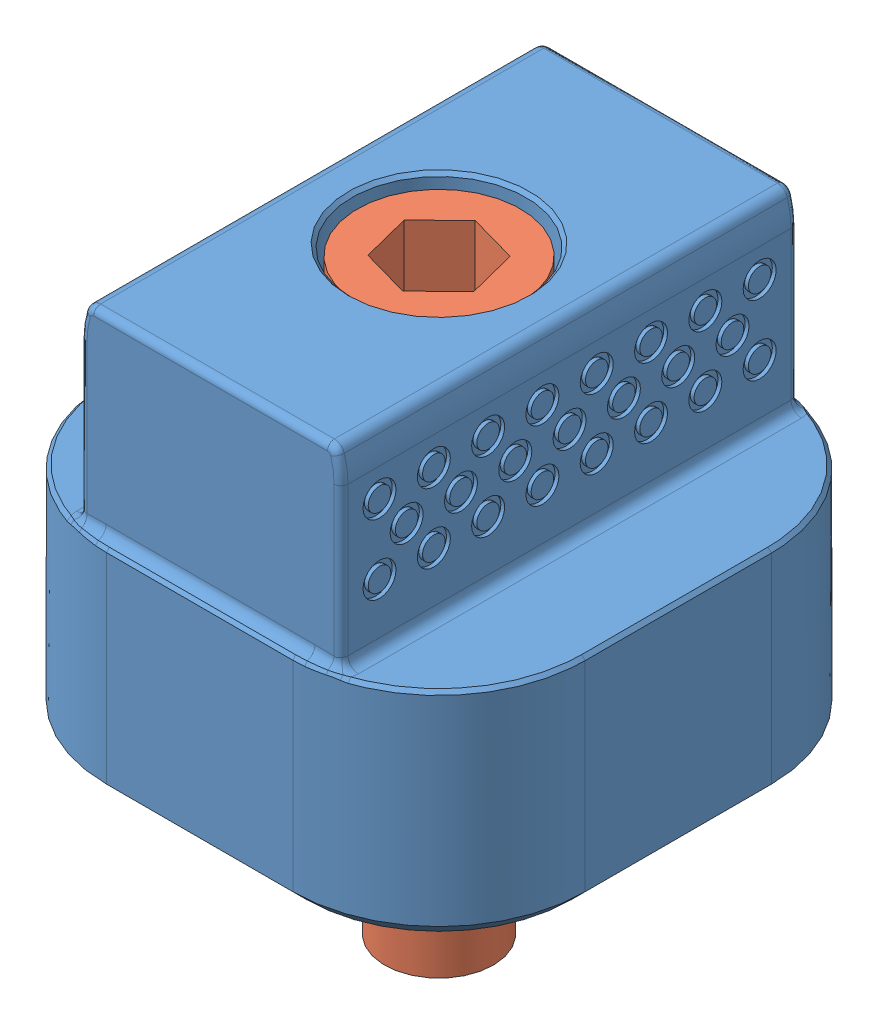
SolidWorks assembly TL137X137 MALE HALF.SLDASM, configuration Default (file format 13000). Lengths in mm.
Overall size (34.93 43.62 34.93).
2 component instances, 2 part files, 1 mates.
Components (placement in the parent):
- TL137X137-M-1: TL137X137-M.SLDPRT [Default] at origin size (34.93 29.84 34.93)
- SHCS31-18L1.37-1: SHCS31-18L1.37.sldprt [SHCS31-18L.75] at (0 5.2705 0) x (0.968882 0 -0.247523) z (0 -1 0) size (11.89 11.89 42.85)
Mates (geometry in assembly coordinates):
- ProfileCenter1: profile center: plane of SHCS31-18L1.37-1 through (-0.9808 5.2705 -3.8391) normal (0 -1 0); circle of TL137X137-M-1
